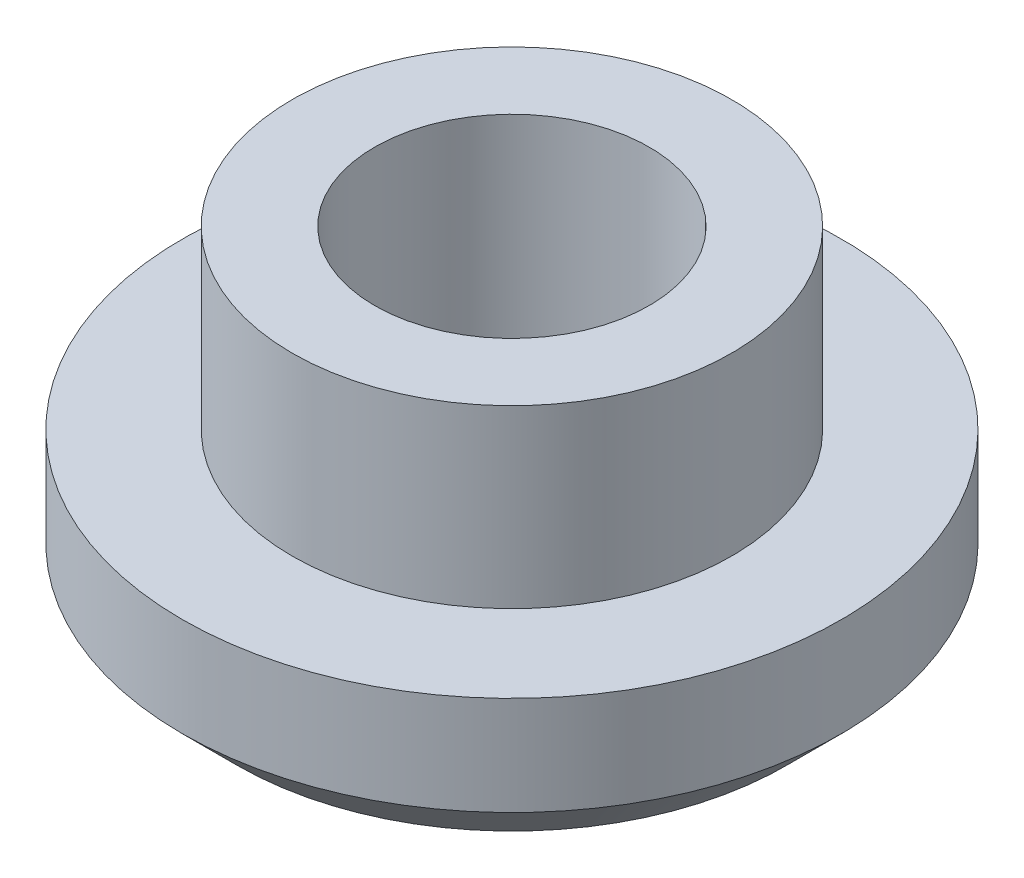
ISO-10303-21;
HEADER;
FILE_DESCRIPTION(('STEP AP214'),'2;1');
FILE_NAME('part.step','',(''),(''),'','','');
FILE_SCHEMA(('AUTOMOTIVE_DESIGN { 1 0 10303 214 1 1 1 1 }'));
ENDSEC;
DATA;
#1=APPLICATION_CONTEXT('core data for automotive mechanical design processes');
#2=APPLICATION_PROTOCOL_DEFINITION('international standard','automotive_design',2000,#1);
#3=PRODUCT_CONTEXT('',#1,'mechanical');
#4=PRODUCT('Part','Part','',(#3));
#5=PRODUCT_RELATED_PRODUCT_CATEGORY('part','',(#4));
#6=PRODUCT_DEFINITION_FORMATION('','',#4);
#7=PRODUCT_DEFINITION_CONTEXT('part definition',#1,'design');
#8=PRODUCT_DEFINITION('design','',#6,#7);
#9=PRODUCT_DEFINITION_SHAPE('','',#8);
#10=(LENGTH_UNIT() NAMED_UNIT(*) SI_UNIT(.MILLI.,.METRE.));
#11=(NAMED_UNIT(*) PLANE_ANGLE_UNIT() SI_UNIT($,.RADIAN.));
#12=(NAMED_UNIT(*) SI_UNIT($,.STERADIAN.) SOLID_ANGLE_UNIT());
#13=UNCERTAINTY_MEASURE_WITH_UNIT(LENGTH_MEASURE(1.E-05),#10,'distance_accuracy_value','');
#14=(GEOMETRIC_REPRESENTATION_CONTEXT(3) GLOBAL_UNCERTAINTY_ASSIGNED_CONTEXT((#13)) GLOBAL_UNIT_ASSIGNED_CONTEXT((#10,
#11,#12)) REPRESENTATION_CONTEXT('',''));
#15=CARTESIAN_POINT('',(0.,0.,0.));
#16=DIRECTION('',(0.,0.,1.));
#17=DIRECTION('',(1.,0.,0.));
#18=AXIS2_PLACEMENT_3D('',#15,#16,#17);
#19=CARTESIAN_POINT('',(0.,2.8,0.));
#20=DIRECTION('',(0.,1.,0.));
#21=DIRECTION('',(0.,0.,1.));
#22=AXIS2_PLACEMENT_3D('',#19,#20,#21);
#23=PLANE('',#22);
#24=CARTESIAN_POINT('',(0.,2.8,0.));
#25=DIRECTION('',(0.,1.,0.));
#26=DIRECTION('',(0.,0.,1.));
#27=AXIS2_PLACEMENT_3D('',#24,#25,#26);
#28=CIRCLE('',#27,6.);
#29=CARTESIAN_POINT('',(0.,2.8,6.));
#30=VERTEX_POINT('',#29);
#31=EDGE_CURVE('E40',#30,#30,#28,.T.);
#32=ORIENTED_EDGE('',*,*,#31,.T.);
#33=EDGE_LOOP('',(#32));
#34=FACE_BOUND('',#33,.T.);
#35=CARTESIAN_POINT('',(0.,2.8,0.));
#36=DIRECTION('',(0.,1.,0.));
#37=DIRECTION('',(0.,0.,1.));
#38=AXIS2_PLACEMENT_3D('',#35,#36,#37);
#39=CIRCLE('',#38,4.);
#40=CARTESIAN_POINT('',(0.,2.8,4.));
#41=VERTEX_POINT('',#40);
#42=EDGE_CURVE('E47',#41,#41,#39,.T.);
#43=ORIENTED_EDGE('',*,*,#42,.F.);
#44=EDGE_LOOP('',(#43));
#45=FACE_BOUND('',#44,.T.);
#46=ADVANCED_FACE('F29',(#34,#45),#23,.T.);
#47=CARTESIAN_POINT('',(0.,2.8,0.));
#48=DIRECTION('',(0.,-1.,0.));
#49=DIRECTION('',(0.,0.,-1.));
#50=AXIS2_PLACEMENT_3D('',#47,#48,#49);
#51=CYLINDRICAL_SURFACE('',#50,6.);
#52=CARTESIAN_POINT('',(0.,1.,0.));
#53=DIRECTION('',(0.,1.,0.));
#54=DIRECTION('',(0.,0.,1.));
#55=AXIS2_PLACEMENT_3D('',#52,#53,#54);
#56=CIRCLE('',#55,6.);
#57=CARTESIAN_POINT('',(0.,1.,6.));
#58=VERTEX_POINT('',#57);
#59=EDGE_CURVE('E36',#58,#58,#56,.T.);
#60=ORIENTED_EDGE('',*,*,#59,.T.);
#61=EDGE_LOOP('',(#60));
#62=FACE_BOUND('',#61,.T.);
#63=ORIENTED_EDGE('',*,*,#31,.F.);
#64=EDGE_LOOP('',(#63));
#65=FACE_BOUND('',#64,.T.);
#66=ADVANCED_FACE('F80',(#62,#65),#51,.T.);
#67=CARTESIAN_POINT('',(0.,0.,0.));
#68=DIRECTION('',(0.,1.,0.));
#69=DIRECTION('',(0.,0.,1.));
#70=AXIS2_PLACEMENT_3D('',#67,#68,#69);
#71=PLANE('',#70);
#72=CARTESIAN_POINT('',(0.,0.,0.));
#73=DIRECTION('',(0.,1.,0.));
#74=DIRECTION('',(0.,0.,1.));
#75=AXIS2_PLACEMENT_3D('',#72,#73,#74);
#76=CIRCLE('',#75,2.5);
#77=CARTESIAN_POINT('',(0.,0.,2.5));
#78=VERTEX_POINT('',#77);
#79=EDGE_CURVE('E50',#78,#78,#76,.T.);
#80=ORIENTED_EDGE('',*,*,#79,.T.);
#81=EDGE_LOOP('',(#80));
#82=FACE_BOUND('',#81,.T.);
#83=CARTESIAN_POINT('',(0.,0.,0.));
#84=DIRECTION('',(0.,1.,0.));
#85=DIRECTION('',(0.,0.,1.));
#86=AXIS2_PLACEMENT_3D('',#83,#84,#85);
#87=CIRCLE('',#86,5.);
#88=CARTESIAN_POINT('',(0.,0.,5.));
#89=VERTEX_POINT('',#88);
#90=EDGE_CURVE('E10',#89,#89,#87,.F.);
#91=ORIENTED_EDGE('',*,*,#90,.T.);
#92=EDGE_LOOP('',(#91));
#93=FACE_BOUND('',#92,.T.);
#94=ADVANCED_FACE('F59',(#82,#93),#71,.F.);
#95=CARTESIAN_POINT('',(0.,1.,0.));
#96=DIRECTION('',(0.,1.,0.));
#97=DIRECTION('',(0.,0.,1.));
#98=AXIS2_PLACEMENT_3D('',#95,#96,#97);
#99=CONICAL_SURFACE('',#98,6.,0.785398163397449);
#100=ORIENTED_EDGE('',*,*,#90,.F.);
#101=EDGE_LOOP('',(#100));
#102=FACE_BOUND('',#101,.T.);
#103=ORIENTED_EDGE('',*,*,#59,.F.);
#104=EDGE_LOOP('',(#103));
#105=FACE_BOUND('',#104,.T.);
#106=ADVANCED_FACE('F31',(#102,#105),#99,.T.);
#107=CARTESIAN_POINT('',(0.,6.,0.));
#108=DIRECTION('',(0.,-1.,0.));
#109=DIRECTION('',(0.,0.,-1.));
#110=AXIS2_PLACEMENT_3D('',#107,#108,#109);
#111=CYLINDRICAL_SURFACE('',#110,4.);
#112=CARTESIAN_POINT('',(0.,6.,0.));
#113=DIRECTION('',(0.,1.,0.));
#114=DIRECTION('',(0.,0.,1.));
#115=AXIS2_PLACEMENT_3D('',#112,#113,#114);
#116=CIRCLE('',#115,4.);
#117=CARTESIAN_POINT('',(0.,6.,4.));
#118=VERTEX_POINT('',#117);
#119=EDGE_CURVE('E44',#118,#118,#116,.T.);
#120=ORIENTED_EDGE('',*,*,#119,.F.);
#121=EDGE_LOOP('',(#120));
#122=FACE_BOUND('',#121,.T.);
#123=ORIENTED_EDGE('',*,*,#42,.T.);
#124=EDGE_LOOP('',(#123));
#125=FACE_BOUND('',#124,.T.);
#126=ADVANCED_FACE('F70',(#122,#125),#111,.T.);
#127=CARTESIAN_POINT('',(0.,6.,0.));
#128=DIRECTION('',(0.,1.,0.));
#129=DIRECTION('',(0.,0.,1.));
#130=AXIS2_PLACEMENT_3D('',#127,#128,#129);
#131=PLANE('',#130);
#132=CARTESIAN_POINT('',(0.,6.,0.));
#133=DIRECTION('',(0.,1.,0.));
#134=DIRECTION('',(0.,0.,1.));
#135=AXIS2_PLACEMENT_3D('',#132,#133,#134);
#136=CIRCLE('',#135,2.5);
#137=CARTESIAN_POINT('',(0.,6.,2.5));
#138=VERTEX_POINT('',#137);
#139=EDGE_CURVE('E53',#138,#138,#136,.T.);
#140=ORIENTED_EDGE('',*,*,#139,.F.);
#141=EDGE_LOOP('',(#140));
#142=FACE_BOUND('',#141,.T.);
#143=ORIENTED_EDGE('',*,*,#119,.T.);
#144=EDGE_LOOP('',(#143));
#145=FACE_BOUND('',#144,.T.);
#146=ADVANCED_FACE('F64',(#142,#145),#131,.T.);
#147=CARTESIAN_POINT('',(0.,0.,0.));
#148=DIRECTION('',(0.,1.,0.));
#149=DIRECTION('',(0.,0.,1.));
#150=AXIS2_PLACEMENT_3D('',#147,#148,#149);
#151=CYLINDRICAL_SURFACE('',#150,2.5);
#152=ORIENTED_EDGE('',*,*,#79,.F.);
#153=EDGE_LOOP('',(#152));
#154=FACE_BOUND('',#153,.T.);
#155=ORIENTED_EDGE('',*,*,#139,.T.);
#156=EDGE_LOOP('',(#155));
#157=FACE_BOUND('',#156,.T.);
#158=ADVANCED_FACE('F61',(#154,#157),#151,.F.);
#159=CLOSED_SHELL('',(#46,#66,#94,#106,#126,#146,#158));
#160=MANIFOLD_SOLID_BREP('B2',#159);
#161=ADVANCED_BREP_SHAPE_REPRESENTATION('',(#18,#160),#14);
#162=SHAPE_DEFINITION_REPRESENTATION(#9,#161);
ENDSEC;
END-ISO-10303-21;
